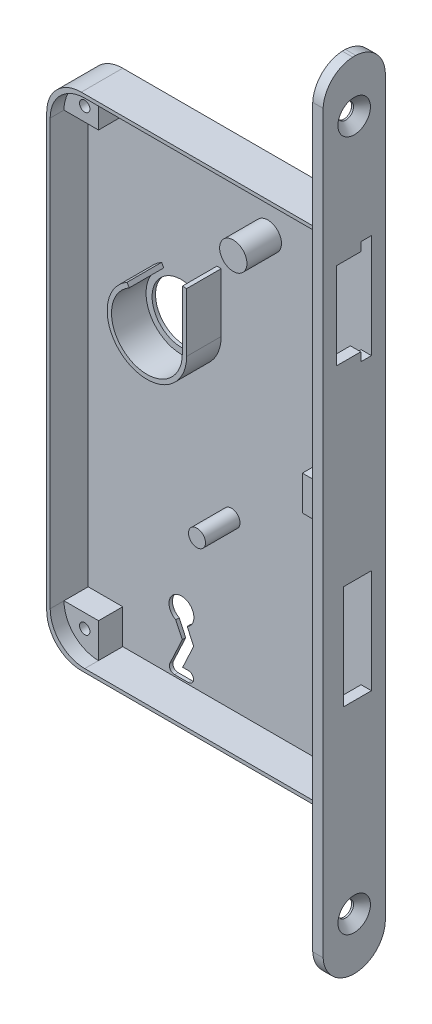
from build123d import *

# Parameters (mm, degrees)
LINEAR_AUSTRAGEN1_DEPTH                     = 9
KASTENHOHLRAUM_DEPTH                        = 143.109113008
KASTENHOHLRAUM_DEPTH_BACK                   = 5
SKIZZE3_W                                   = 3
SKIZZE3_H                                   = 145
KASTENBREITE_DEPTH                          = 80
STULPABRUNDUNG_REACH                        = 144.109
SKIZZE5_W                                   = 8.1
SKIZZE5_H                                   = 30.1
AUSSPARUNG_F_R_FALLE_UND_RIEGELL_DEPTH      = 10
FORMSENKUNG_F_R_M4_SENKSCHRAUBE_MIT_2_COUNT = 2
FORMSENKUNG_F_R_M4_SENKSCHRAUBE_MIT_2_PITCH = 200
SKIZZE12_R                                  = 3.95
SKIZZE12_R_2                                = 2.45
LINEAR_AUSTRAGEN7_DEPTH                     = 10
AUSTRAG_F_R_NUSS_REACH                      = 144.513
SKIZZE13_R                                  = 8.5
AUSTRAG_F_R_SCHL_SSELLOCH_REACH             = 144.615
M3_GEWINDEBOHRUNG1_D                        = 2.5
M3_GEWINDEBOHRUNG1_DEPTH                    = 10.5
M3_GEWINDEBOHRUNG1_CBORE_D                  = 3
M3_GEWINDEBOHRUNG1_CBORE_DEPTH              = 8
M3_GEWINDEBOHRUNG1_TIP                      = 0.751075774
SKIZZE16_W                                  = 10
SKIZZE16_H                                  = 10
LINEAR_AUSTRAGEN9_DEPTH                     = 4


with BuildPart() as part:
    # Skizze1 → Linear austragen1 (new, symmetric)
    with BuildSketch(Plane.XY):
        with BuildLine():
            Line((0, 115), (0, -115))
            Line((0, -115), (-3, -115))
            Line((-3, -115), (-3, -72.5))
            Line((-3, -72.5), (-73, -72.5))
            ThreePointArc((-73, -72.5), (-80.071067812, -69.571067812), (-83, -62.5))
            Line((-83, -62.5), (-83, 62.5))
            ThreePointArc((-83, 62.5), (-80.071067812, 69.571067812), (-73, 72.5))
            Line((-73, 72.5), (-3, 72.5))
            Line((-3, 72.5), (-3, 115))
            Line((-3, 115), (0, 115))
        make_face()
    extrude(amount=LINEAR_AUSTRAGEN1_DEPTH, both=True)

    # Skizze2 → Kastenhohlraum (cut, two sides: drawn at the far end of the back side and taken through both)
    with BuildSketch(Plane.XY.offset(-KASTENHOHLRAUM_DEPTH_BACK)):
        Polygon((-72, 71.5), (-3, 71.5), (-3, 5), (-13, 5), (-13, -5), (-3, -5), (-3, -71.5), (-72, -71.5), (-72, -61.5), (-82, -61.5), (-82, 61.5), (-72, 61.5), align=None)
    extrude(amount=KASTENHOHLRAUM_DEPTH + KASTENHOHLRAUM_DEPTH_BACK, mode=Mode.SUBTRACT)

    # Skizze3 → Kastenbreite (cut)
    with BuildSketch(Plane(origin=(-83, 0, 0), x_dir=(0, 0, -1), z_dir=(1, 0, 0))):
        with Locations((-7.5, 0)):
            Rectangle(SKIZZE3_W, SKIZZE3_H)
        with Locations((7.5, 0)):
            Rectangle(SKIZZE3_W, SKIZZE3_H)
    extrude(amount=KASTENBREITE_DEPTH, mode=Mode.SUBTRACT)

    # Skizze4 → Stulpabrundung (cut, up to next)
    with BuildSketch(Plane(origin=(0, 0, 0), x_dir=(0, 0, -1), z_dir=(1, 0, 0)), mode=Mode.PRIVATE) as stulpabrundung_sk1:
        with BuildLine():
            Line((9, 115), (0.444220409, 115))
            ThreePointArc((0.444220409, 115), (6.371708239, 112.371708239), (9, 106.444220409))
            Line((9, 106.444220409), (9, 115))
        make_face()
    stulpabrundung_tool1 = extrude(stulpabrundung_sk1.sketch, amount=-STULPABRUNDUNG_REACH, mode=Mode.PRIVATE) & part.part
    # Skizze4 → Stulpabrundung (cut, up to next)
    with BuildSketch(Plane(origin=(0, 0, 0), x_dir=(0, 0, -1), z_dir=(1, 0, 0)), mode=Mode.PRIVATE) as stulpabrundung_sk2:
        with BuildLine():
            Line((-9, 115), (-9, 106.444220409))
            ThreePointArc((-9, 106.444220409), (-6.371708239, 112.371708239), (-0.444220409, 115))
            Line((-0.444220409, 115), (-9, 115))
        make_face()
    stulpabrundung_tool2 = extrude(stulpabrundung_sk2.sketch, amount=-STULPABRUNDUNG_REACH, mode=Mode.PRIVATE) & part.part
    # Skizze4 → Stulpabrundung (cut, up to next)
    with BuildSketch(Plane(origin=(0, 0, 0), x_dir=(0, 0, -1), z_dir=(1, 0, 0)), mode=Mode.PRIVATE) as stulpabrundung_sk3:
        with BuildLine():
            ThreePointArc((9, -106.496376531), (6.373632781, -112.373632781), (0.496376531, -115))
            Line((0.496376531, -115), (9, -115))
            Line((9, -115), (9, -106.496376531))
        make_face()
    stulpabrundung_tool3 = extrude(stulpabrundung_sk3.sketch, amount=-STULPABRUNDUNG_REACH, mode=Mode.PRIVATE) & part.part
    # Skizze4 → Stulpabrundung (cut, up to next)
    with BuildSketch(Plane(origin=(0, 0, 0), x_dir=(0, 0, -1), z_dir=(1, 0, 0)), mode=Mode.PRIVATE) as stulpabrundung_sk4:
        with BuildLine():
            ThreePointArc((-0.496376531, -115), (-6.373632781, -112.373632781), (-9, -106.496376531))
            Line((-9, -106.496376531), (-9, -115))
            Line((-9, -115), (-0.496376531, -115))
        make_face()
    stulpabrundung_tool4 = extrude(stulpabrundung_sk4.sketch, amount=-STULPABRUNDUNG_REACH, mode=Mode.PRIVATE) & part.part
    add(stulpabrundung_tool1.solids().sort_by_distance((0, 113.000084, -7.000084))[0], mode=Mode.SUBTRACT)
    add(stulpabrundung_tool2.solids().sort_by_distance((0, 113.000084, 7.000084))[0], mode=Mode.SUBTRACT)
    add(stulpabrundung_tool3.solids().sort_by_distance((0, -113.002558, -7.002558))[0], mode=Mode.SUBTRACT)
    add(stulpabrundung_tool4.solids().sort_by_distance((0, -113.002558, 7.002558))[0], mode=Mode.SUBTRACT)

    # Skizze5 → Aussparung f_r Falle und Riegell (cut)
    with BuildSketch(Plane(origin=(0, 0, 0), x_dir=(0, 0, -1), z_dir=(1, 0, 0))):
        Polygon((5, 67.55), (5, 37.45), (1.9, 37.45), (1.9, 39.95), (-5.1, 39.95), (-5.1, 65.05), (1.9, 65.05), (1.9, 67.55), align=None)
        with Locations((0.95, -31.5)):
            Rectangle(SKIZZE5_W, SKIZZE5_H)
    extrude(amount=-AUSSPARUNG_F_R_FALLE_UND_RIEGELL_DEPTH, mode=Mode.SUBTRACT)

    # Skizze11 → Formsenkung f_r M4 Senkschraube mit Schl (revolve, cut)
    with BuildSketch(Plane(origin=(0, 100, 0), x_dir=(0, 0, -1), z_dir=(0, 1, 0))):
        Polygon((0, 0), (0, 3), (2.275, 3), (2.25, 2.975), (2.25, 2.45), (4.7, 0), align=None)
    formsenkung_f_r_m4_senkschraube_mit_schl = revolve(axis=Axis((6.35, 100, 0), (-1, 0, 0)), mode=Mode.SUBTRACT)

    # Formsenkung f_r M4 Senkschraube mit  2: Formsenkung f_r M4 Senkschraube mit Schl ×2
    with Locations(*[(0, -i * FORMSENKUNG_F_R_M4_SENKSCHRAUBE_MIT_2_PITCH, 0) for i in range(1, FORMSENKUNG_F_R_M4_SENKSCHRAUBE_MIT_2_COUNT)]):
        add(formsenkung_f_r_m4_senkschraube_mit_schl, mode=Mode.SUBTRACT)

    # Skizze12 → Linear austragen7 (add)
    with BuildSketch(Plane.XY.offset(-5)):
        with Locations(Location((-30, 52.5, 0), (0, 0, 180))):
            Circle(SKIZZE12_R)
        with Locations(Location((-40.5, -23.5, 0), (0, 0, 180))):
            Circle(SKIZZE12_R_2)
        with BuildLine():
            Line((-43.5, 20.5), (-43.5, 37.5))
            Line((-43.5, 37.5), (-44.75, 37.5))
            Line((-44.75, 37.5), (-44.75, 20.5))
            ThreePointArc((-44.75, 20.5), (-60.125, 11.623239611), (-60.125, 29.376760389))
            Line((-60.125, 29.376760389), (-60.75, 30.459292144))
            ThreePointArc((-60.75, 30.459292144), (-60.75, 10.540707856), (-43.5, 20.5))
        make_face()
    extrude(amount=LINEAR_AUSTRAGEN7_DEPTH)

    # Skizze13 → Austrag f_r Nuss (cut, up to next)
    with BuildSketch(Plane.XY.offset(-5), mode=Mode.PRIVATE) as austrag_f_r_nuss_sk1:
        with Locations((-55, 20.5)):
            Circle(SKIZZE13_R)
    austrag_f_r_nuss_tool1 = extrude(austrag_f_r_nuss_sk1.sketch, amount=-AUSTRAG_F_R_NUSS_REACH, mode=Mode.PRIVATE) & part.part
    add(austrag_f_r_nuss_tool1.solids().sort_by_distance((-55, 20.5, -5))[0], mode=Mode.SUBTRACT)

    # Skizze14 → Austrag f_r Schl_sselloch (cut, up to next)
    with BuildSketch(Plane.XY.offset(-6), mode=Mode.PRIVATE) as austrag_f_r_schl_sselloch_sk1:
        with BuildLine():
            Line((-56.655066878, -57.09699134), (-54.763257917, -61.153988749))
            Line((-54.763257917, -61.153988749), (-58.359461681, -68.866072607))
            ThreePointArc((-58.359461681, -68.866072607), (-58.265087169, -70.305949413), (-57, -71))
            Line((-57, -71), (-53, -71))
            ThreePointArc((-53, -71), (-51.5, -69.5), (-53, -68))
            Line((-53, -68), (-54.645471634, -68))
            Line((-54.645471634, -68), (-51.45312416, -61.153988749))
            Line((-51.45312416, -61.153988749), (-53.344933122, -57.09699134))
            ThreePointArc((-53.344933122, -57.09699134), (-55, -50.3), (-56.655066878, -57.09699134))
        make_face()
    austrag_f_r_schl_sselloch_tool1 = extrude(austrag_f_r_schl_sselloch_sk1.sketch, amount=AUSTRAG_F_R_SCHL_SSELLOCH_REACH, mode=Mode.PRIVATE) & part.part
    add(austrag_f_r_schl_sselloch_tool1.solids().sort_by_distance((-54.800738, -60.299778, -6))[0], mode=Mode.SUBTRACT)

    # M3 Gewindebohrung1
    with Locations(Plane(origin=(-76, 65.5, 6), x_dir=(0, 1, 0), z_dir=(0, 0, 1))):
        with Locations((0, 0), (-131, 0), (-65.5, -68)):
            CounterBoreHole(M3_GEWINDEBOHRUNG1_D / 2, M3_GEWINDEBOHRUNG1_CBORE_D / 2, M3_GEWINDEBOHRUNG1_CBORE_DEPTH, depth=M3_GEWINDEBOHRUNG1_DEPTH)
            with Locations((0, 0, -(M3_GEWINDEBOHRUNG1_DEPTH + M3_GEWINDEBOHRUNG1_TIP / 2))):  # 118° drill point
                Cone(0, M3_GEWINDEBOHRUNG1_D / 2, M3_GEWINDEBOHRUNG1_TIP, mode=Mode.SUBTRACT)

    # Skizze16 → Linear austragen9 (cut)
    with BuildSketch(Plane.XY.offset(6)):
        with BuildLine():
            Line((-82, 61.5), (-72, 61.5))
            Line((-72, 61.5), (-72, 71.5))
            ThreePointArc((-72, 71.5), (-79.071067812, 68.571067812), (-82, 61.5))
        make_face()
        with Locations((-8, 0)):
            Rectangle(SKIZZE16_W, SKIZZE16_H)
        with BuildLine():
            Line((-82, -61.5), (-72, -61.5))
            Line((-72, -61.5), (-72, -71.5))
            ThreePointArc((-72, -71.5), (-79.071067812, -68.571067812), (-82, -61.5))
        make_face()
    extrude(amount=-LINEAR_AUSTRAGEN9_DEPTH, mode=Mode.SUBTRACT)


solid = part.part
